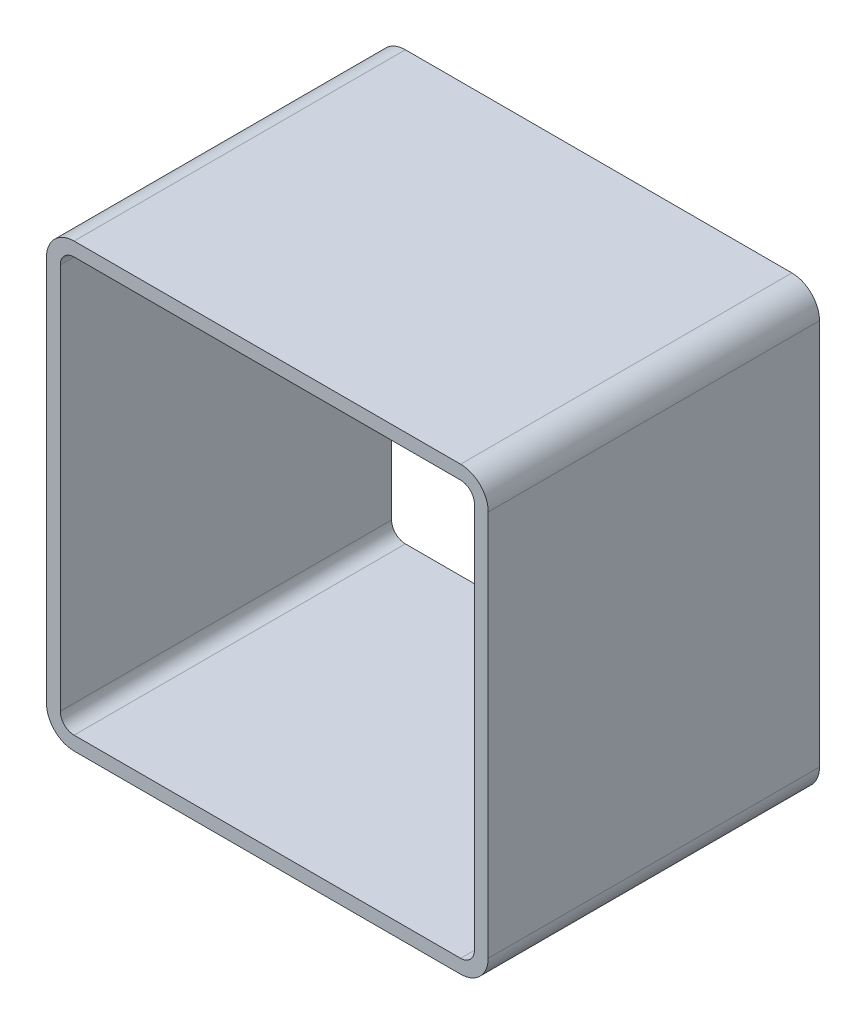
ISO-10303-21;
HEADER;
FILE_DESCRIPTION(('STEP AP214'),'2;1');
FILE_NAME('part.step','',(''),(''),'','','');
FILE_SCHEMA(('AUTOMOTIVE_DESIGN { 1 0 10303 214 1 1 1 1 }'));
ENDSEC;
DATA;
#1=APPLICATION_CONTEXT('core data for automotive mechanical design processes');
#2=APPLICATION_PROTOCOL_DEFINITION('international standard','automotive_design',2000,#1);
#3=PRODUCT_CONTEXT('',#1,'mechanical');
#4=PRODUCT('Part','Part','',(#3));
#5=PRODUCT_RELATED_PRODUCT_CATEGORY('part','',(#4));
#6=PRODUCT_DEFINITION_FORMATION('','',#4);
#7=PRODUCT_DEFINITION_CONTEXT('part definition',#1,'design');
#8=PRODUCT_DEFINITION('design','',#6,#7);
#9=PRODUCT_DEFINITION_SHAPE('','',#8);
#10=(LENGTH_UNIT() NAMED_UNIT(*) SI_UNIT(.MILLI.,.METRE.));
#11=(NAMED_UNIT(*) PLANE_ANGLE_UNIT() SI_UNIT($,.RADIAN.));
#12=(NAMED_UNIT(*) SI_UNIT($,.STERADIAN.) SOLID_ANGLE_UNIT());
#13=UNCERTAINTY_MEASURE_WITH_UNIT(LENGTH_MEASURE(1.E-05),#10,'distance_accuracy_value','');
#14=(GEOMETRIC_REPRESENTATION_CONTEXT(3) GLOBAL_UNCERTAINTY_ASSIGNED_CONTEXT((#13)) GLOBAL_UNIT_ASSIGNED_CONTEXT((#10,
#11,#12)) REPRESENTATION_CONTEXT('',''));
#15=CARTESIAN_POINT('',(0.,0.,0.));
#16=DIRECTION('',(0.,0.,1.));
#17=DIRECTION('',(1.,0.,0.));
#18=AXIS2_PLACEMENT_3D('',#15,#16,#17);
#19=CARTESIAN_POINT('',(381.822465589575,27.1828624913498,304.8));
#20=DIRECTION('',(0.,0.,1.));
#21=DIRECTION('',(1.,0.,0.));
#22=AXIS2_PLACEMENT_3D('',#19,#20,#21);
#23=PLANE('',#22);
#24=CARTESIAN_POINT('',(381.822465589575,27.1828624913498,304.8));
#25=DIRECTION('',(0.,0.,1.));
#26=DIRECTION('',(1.,0.,0.));
#27=AXIS2_PLACEMENT_3D('',#24,#25,#26);
#28=CIRCLE('',#27,25.4);
#29=CARTESIAN_POINT('',(381.822465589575,1.7828624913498,304.8));
#30=VERTEX_POINT('',#29);
#31=CARTESIAN_POINT('',(407.222465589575,27.1828624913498,304.8));
#32=VERTEX_POINT('',#31);
#33=EDGE_CURVE('E211',#30,#32,#28,.T.);
#34=ORIENTED_EDGE('',*,*,#33,.T.);
#35=DIRECTION('',(0.,1.,0.));
#36=VECTOR('',#35,1.);
#37=CARTESIAN_POINT('',(407.222465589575,382.78286249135,304.8));
#38=LINE('',#37,#36);
#39=CARTESIAN_POINT('',(407.222465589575,382.78286249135,304.8));
#40=VERTEX_POINT('',#39);
#41=EDGE_CURVE('E214',#32,#40,#38,.T.);
#42=ORIENTED_EDGE('',*,*,#41,.T.);
#43=CARTESIAN_POINT('',(381.822465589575,382.78286249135,304.8));
#44=DIRECTION('',(0.,0.,1.));
#45=DIRECTION('',(1.,0.,0.));
#46=AXIS2_PLACEMENT_3D('',#43,#44,#45);
#47=CIRCLE('',#46,25.4);
#48=CARTESIAN_POINT('',(381.822465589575,408.18286249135,304.8));
#49=VERTEX_POINT('',#48);
#50=EDGE_CURVE('E217',#40,#49,#47,.T.);
#51=ORIENTED_EDGE('',*,*,#50,.T.);
#52=DIRECTION('',(-1.,0.,0.));
#53=VECTOR('',#52,1.);
#54=CARTESIAN_POINT('',(26.222465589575,408.18286249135,304.8));
#55=LINE('',#54,#53);
#56=CARTESIAN_POINT('',(26.222465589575,408.18286249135,304.8));
#57=VERTEX_POINT('',#56);
#58=EDGE_CURVE('E219',#49,#57,#55,.T.);
#59=ORIENTED_EDGE('',*,*,#58,.T.);
#60=CARTESIAN_POINT('',(26.222465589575,382.78286249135,304.8));
#61=DIRECTION('',(0.,0.,1.));
#62=DIRECTION('',(1.,0.,0.));
#63=AXIS2_PLACEMENT_3D('',#60,#61,#62);
#64=CIRCLE('',#63,25.4);
#65=CARTESIAN_POINT('',(0.82246558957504,382.78286249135,304.8));
#66=VERTEX_POINT('',#65);
#67=EDGE_CURVE('E221',#57,#66,#64,.T.);
#68=ORIENTED_EDGE('',*,*,#67,.T.);
#69=DIRECTION('',(0.,-1.,0.));
#70=VECTOR('',#69,1.);
#71=CARTESIAN_POINT('',(0.82246558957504,27.1828624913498,304.8));
#72=LINE('',#71,#70);
#73=CARTESIAN_POINT('',(0.822465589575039,27.1828624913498,304.8));
#74=VERTEX_POINT('',#73);
#75=EDGE_CURVE('E223',#66,#74,#72,.T.);
#76=ORIENTED_EDGE('',*,*,#75,.T.);
#77=CARTESIAN_POINT('',(26.222465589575,27.1828624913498,304.8));
#78=DIRECTION('',(0.,0.,1.));
#79=DIRECTION('',(1.,0.,0.));
#80=AXIS2_PLACEMENT_3D('',#77,#78,#79);
#81=CIRCLE('',#80,25.4);
#82=CARTESIAN_POINT('',(26.222465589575,1.7828624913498,304.8));
#83=VERTEX_POINT('',#82);
#84=EDGE_CURVE('E225',#74,#83,#81,.T.);
#85=ORIENTED_EDGE('',*,*,#84,.T.);
#86=DIRECTION('',(1.,0.,0.));
#87=VECTOR('',#86,1.);
#88=CARTESIAN_POINT('',(381.822465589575,1.7828624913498,304.8));
#89=LINE('',#88,#87);
#90=EDGE_CURVE('E227',#83,#30,#89,.T.);
#91=ORIENTED_EDGE('',*,*,#90,.T.);
#92=EDGE_LOOP('',(#34,#42,#51,#59,#68,#76,#85,#91));
#93=FACE_BOUND('',#92,.T.);
#94=DIRECTION('',(0.,-1.,0.));
#95=VECTOR('',#94,1.);
#96=CARTESIAN_POINT('',(13.522465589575,27.1828624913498,304.8));
#97=LINE('',#96,#95);
#98=CARTESIAN_POINT('',(13.522465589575,382.78286249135,304.8));
#99=VERTEX_POINT('',#98);
#100=CARTESIAN_POINT('',(13.522465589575,27.1828624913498,304.8));
#101=VERTEX_POINT('',#100);
#102=EDGE_CURVE('E154',#99,#101,#97,.T.);
#103=ORIENTED_EDGE('',*,*,#102,.F.);
#104=CARTESIAN_POINT('',(26.222465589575,382.78286249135,304.8));
#105=DIRECTION('',(0.,0.,1.));
#106=DIRECTION('',(1.,0.,0.));
#107=AXIS2_PLACEMENT_3D('',#104,#105,#106);
#108=CIRCLE('',#107,12.7);
#109=CARTESIAN_POINT('',(26.222465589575,395.48286249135,304.8));
#110=VERTEX_POINT('',#109);
#111=EDGE_CURVE('E146',#110,#99,#108,.T.);
#112=ORIENTED_EDGE('',*,*,#111,.F.);
#113=DIRECTION('',(-1.,0.,0.));
#114=VECTOR('',#113,1.);
#115=CARTESIAN_POINT('',(26.222465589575,395.48286249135,304.8));
#116=LINE('',#115,#114);
#117=CARTESIAN_POINT('',(381.822465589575,395.48286249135,304.8));
#118=VERTEX_POINT('',#117);
#119=EDGE_CURVE('E179',#118,#110,#116,.T.);
#120=ORIENTED_EDGE('',*,*,#119,.F.);
#121=CARTESIAN_POINT('',(381.822465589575,382.78286249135,304.8));
#122=DIRECTION('',(0.,0.,1.));
#123=DIRECTION('',(1.,0.,0.));
#124=AXIS2_PLACEMENT_3D('',#121,#122,#123);
#125=CIRCLE('',#124,12.7);
#126=CARTESIAN_POINT('',(394.522465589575,382.78286249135,304.8));
#127=VERTEX_POINT('',#126);
#128=EDGE_CURVE('E177',#127,#118,#125,.T.);
#129=ORIENTED_EDGE('',*,*,#128,.F.);
#130=DIRECTION('',(0.,1.,0.));
#131=VECTOR('',#130,1.);
#132=CARTESIAN_POINT('',(394.522465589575,382.78286249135,304.8));
#133=LINE('',#132,#131);
#134=CARTESIAN_POINT('',(394.522465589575,27.1828624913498,304.8));
#135=VERTEX_POINT('',#134);
#136=EDGE_CURVE('E175',#135,#127,#133,.T.);
#137=ORIENTED_EDGE('',*,*,#136,.F.);
#138=CARTESIAN_POINT('',(381.822465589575,27.1828624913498,304.8));
#139=DIRECTION('',(0.,0.,1.));
#140=DIRECTION('',(1.,0.,0.));
#141=AXIS2_PLACEMENT_3D('',#138,#139,#140);
#142=CIRCLE('',#141,12.7);
#143=CARTESIAN_POINT('',(381.822465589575,14.4828624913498,304.8));
#144=VERTEX_POINT('',#143);
#145=EDGE_CURVE('E173',#144,#135,#142,.T.);
#146=ORIENTED_EDGE('',*,*,#145,.F.);
#147=DIRECTION('',(1.,0.,0.));
#148=VECTOR('',#147,1.);
#149=CARTESIAN_POINT('',(381.822465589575,14.4828624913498,304.8));
#150=LINE('',#149,#148);
#151=CARTESIAN_POINT('',(26.222465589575,14.4828624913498,304.8));
#152=VERTEX_POINT('',#151);
#153=EDGE_CURVE('E169',#152,#144,#150,.T.);
#154=ORIENTED_EDGE('',*,*,#153,.F.);
#155=CARTESIAN_POINT('',(26.222465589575,27.1828624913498,304.8));
#156=DIRECTION('',(0.,0.,1.));
#157=DIRECTION('',(1.,0.,0.));
#158=AXIS2_PLACEMENT_3D('',#155,#156,#157);
#159=CIRCLE('',#158,12.7);
#160=EDGE_CURVE('E167',#101,#152,#159,.T.);
#161=ORIENTED_EDGE('',*,*,#160,.F.);
#162=EDGE_LOOP('',(#103,#112,#120,#129,#137,#146,#154,#161));
#163=FACE_BOUND('',#162,.T.);
#164=ADVANCED_FACE('F33',(#93,#163),#23,.T.);
#165=CARTESIAN_POINT('',(381.822465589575,27.1828624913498,0.));
#166=DIRECTION('',(0.,0.,1.));
#167=DIRECTION('',(1.,0.,0.));
#168=AXIS2_PLACEMENT_3D('',#165,#166,#167);
#169=PLANE('',#168);
#170=CARTESIAN_POINT('',(381.822465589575,27.1828624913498,0.));
#171=DIRECTION('',(0.,0.,1.));
#172=DIRECTION('',(1.,0.,0.));
#173=AXIS2_PLACEMENT_3D('',#170,#171,#172);
#174=CIRCLE('',#173,25.4);
#175=CARTESIAN_POINT('',(381.822465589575,1.7828624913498,0.));
#176=VERTEX_POINT('',#175);
#177=CARTESIAN_POINT('',(407.222465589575,27.1828624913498,0.));
#178=VERTEX_POINT('',#177);
#179=EDGE_CURVE('E162',#176,#178,#174,.T.);
#180=ORIENTED_EDGE('',*,*,#179,.F.);
#181=DIRECTION('',(1.,0.,0.));
#182=VECTOR('',#181,1.);
#183=CARTESIAN_POINT('',(381.822465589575,1.7828624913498,0.));
#184=LINE('',#183,#182);
#185=CARTESIAN_POINT('',(26.222465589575,1.7828624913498,0.));
#186=VERTEX_POINT('',#185);
#187=EDGE_CURVE('E215',#186,#176,#184,.T.);
#188=ORIENTED_EDGE('',*,*,#187,.F.);
#189=CARTESIAN_POINT('',(26.222465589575,27.1828624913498,0.));
#190=DIRECTION('',(0.,0.,1.));
#191=DIRECTION('',(1.,0.,0.));
#192=AXIS2_PLACEMENT_3D('',#189,#190,#191);
#193=CIRCLE('',#192,25.4);
#194=CARTESIAN_POINT('',(0.822465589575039,27.1828624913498,0.));
#195=VERTEX_POINT('',#194);
#196=EDGE_CURVE('E242',#195,#186,#193,.T.);
#197=ORIENTED_EDGE('',*,*,#196,.F.);
#198=DIRECTION('',(0.,-1.,0.));
#199=VECTOR('',#198,1.);
#200=CARTESIAN_POINT('',(0.82246558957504,27.1828624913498,0.));
#201=LINE('',#200,#199);
#202=CARTESIAN_POINT('',(0.82246558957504,382.78286249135,0.));
#203=VERTEX_POINT('',#202);
#204=EDGE_CURVE('E240',#203,#195,#201,.T.);
#205=ORIENTED_EDGE('',*,*,#204,.F.);
#206=CARTESIAN_POINT('',(26.222465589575,382.78286249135,0.));
#207=DIRECTION('',(0.,0.,1.));
#208=DIRECTION('',(1.,0.,0.));
#209=AXIS2_PLACEMENT_3D('',#206,#207,#208);
#210=CIRCLE('',#209,25.4);
#211=CARTESIAN_POINT('',(26.222465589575,408.18286249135,0.));
#212=VERTEX_POINT('',#211);
#213=EDGE_CURVE('E238',#212,#203,#210,.T.);
#214=ORIENTED_EDGE('',*,*,#213,.F.);
#215=DIRECTION('',(-1.,0.,0.));
#216=VECTOR('',#215,1.);
#217=CARTESIAN_POINT('',(26.222465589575,408.18286249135,0.));
#218=LINE('',#217,#216);
#219=CARTESIAN_POINT('',(381.822465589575,408.18286249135,0.));
#220=VERTEX_POINT('',#219);
#221=EDGE_CURVE('E236',#220,#212,#218,.T.);
#222=ORIENTED_EDGE('',*,*,#221,.F.);
#223=CARTESIAN_POINT('',(381.822465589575,382.78286249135,0.));
#224=DIRECTION('',(0.,0.,1.));
#225=DIRECTION('',(1.,0.,0.));
#226=AXIS2_PLACEMENT_3D('',#223,#224,#225);
#227=CIRCLE('',#226,25.4);
#228=CARTESIAN_POINT('',(407.222465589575,382.78286249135,0.));
#229=VERTEX_POINT('',#228);
#230=EDGE_CURVE('E234',#229,#220,#227,.T.);
#231=ORIENTED_EDGE('',*,*,#230,.F.);
#232=DIRECTION('',(0.,1.,0.));
#233=VECTOR('',#232,1.);
#234=CARTESIAN_POINT('',(407.222465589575,382.78286249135,0.));
#235=LINE('',#234,#233);
#236=EDGE_CURVE('E232',#178,#229,#235,.T.);
#237=ORIENTED_EDGE('',*,*,#236,.F.);
#238=EDGE_LOOP('',(#180,#188,#197,#205,#214,#222,#231,#237));
#239=FACE_BOUND('',#238,.T.);
#240=CARTESIAN_POINT('',(26.222465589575,382.78286249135,0.));
#241=DIRECTION('',(0.,0.,1.));
#242=DIRECTION('',(1.,0.,0.));
#243=AXIS2_PLACEMENT_3D('',#240,#241,#242);
#244=CIRCLE('',#243,12.7);
#245=CARTESIAN_POINT('',(26.222465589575,395.48286249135,0.));
#246=VERTEX_POINT('',#245);
#247=CARTESIAN_POINT('',(13.522465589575,382.78286249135,0.));
#248=VERTEX_POINT('',#247);
#249=EDGE_CURVE('E56',#246,#248,#244,.T.);
#250=ORIENTED_EDGE('',*,*,#249,.T.);
#251=DIRECTION('',(0.,-1.,0.));
#252=VECTOR('',#251,1.);
#253=CARTESIAN_POINT('',(13.522465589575,27.1828624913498,0.));
#254=LINE('',#253,#252);
#255=CARTESIAN_POINT('',(13.522465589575,27.1828624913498,0.));
#256=VERTEX_POINT('',#255);
#257=EDGE_CURVE('E161',#248,#256,#254,.T.);
#258=ORIENTED_EDGE('',*,*,#257,.T.);
#259=CARTESIAN_POINT('',(26.222465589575,27.1828624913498,0.));
#260=DIRECTION('',(0.,0.,1.));
#261=DIRECTION('',(1.,0.,0.));
#262=AXIS2_PLACEMENT_3D('',#259,#260,#261);
#263=CIRCLE('',#262,12.7);
#264=CARTESIAN_POINT('',(26.222465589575,14.4828624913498,0.));
#265=VERTEX_POINT('',#264);
#266=EDGE_CURVE('E183',#256,#265,#263,.T.);
#267=ORIENTED_EDGE('',*,*,#266,.T.);
#268=DIRECTION('',(1.,0.,0.));
#269=VECTOR('',#268,1.);
#270=CARTESIAN_POINT('',(381.822465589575,14.4828624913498,0.));
#271=LINE('',#270,#269);
#272=CARTESIAN_POINT('',(381.822465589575,14.4828624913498,0.));
#273=VERTEX_POINT('',#272);
#274=EDGE_CURVE('E186',#265,#273,#271,.T.);
#275=ORIENTED_EDGE('',*,*,#274,.T.);
#276=CARTESIAN_POINT('',(381.822465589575,27.1828624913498,0.));
#277=DIRECTION('',(0.,0.,1.));
#278=DIRECTION('',(1.,0.,0.));
#279=AXIS2_PLACEMENT_3D('',#276,#277,#278);
#280=CIRCLE('',#279,12.7);
#281=CARTESIAN_POINT('',(394.522465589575,27.1828624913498,0.));
#282=VERTEX_POINT('',#281);
#283=EDGE_CURVE('E189',#273,#282,#280,.T.);
#284=ORIENTED_EDGE('',*,*,#283,.T.);
#285=DIRECTION('',(0.,1.,0.));
#286=VECTOR('',#285,1.);
#287=CARTESIAN_POINT('',(394.522465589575,382.78286249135,0.));
#288=LINE('',#287,#286);
#289=CARTESIAN_POINT('',(394.522465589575,382.78286249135,0.));
#290=VERTEX_POINT('',#289);
#291=EDGE_CURVE('E192',#282,#290,#288,.T.);
#292=ORIENTED_EDGE('',*,*,#291,.T.);
#293=CARTESIAN_POINT('',(381.822465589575,382.78286249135,0.));
#294=DIRECTION('',(0.,0.,1.));
#295=DIRECTION('',(1.,0.,0.));
#296=AXIS2_PLACEMENT_3D('',#293,#294,#295);
#297=CIRCLE('',#296,12.7);
#298=CARTESIAN_POINT('',(381.822465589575,395.48286249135,0.));
#299=VERTEX_POINT('',#298);
#300=EDGE_CURVE('E195',#290,#299,#297,.T.);
#301=ORIENTED_EDGE('',*,*,#300,.T.);
#302=DIRECTION('',(-1.,0.,0.));
#303=VECTOR('',#302,1.);
#304=CARTESIAN_POINT('',(26.222465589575,395.48286249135,0.));
#305=LINE('',#304,#303);
#306=EDGE_CURVE('E155',#299,#246,#305,.T.);
#307=ORIENTED_EDGE('',*,*,#306,.T.);
#308=EDGE_LOOP('',(#250,#258,#267,#275,#284,#292,#301,#307));
#309=FACE_BOUND('',#308,.T.);
#310=ADVANCED_FACE('F272',(#239,#309),#169,.F.);
#311=CARTESIAN_POINT('',(381.822465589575,27.1828624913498,304.8));
#312=DIRECTION('',(0.,0.,-1.));
#313=DIRECTION('',(-1.,0.,0.));
#314=AXIS2_PLACEMENT_3D('',#311,#312,#313);
#315=CYLINDRICAL_SURFACE('',#314,25.4);
#316=ORIENTED_EDGE('',*,*,#179,.T.);
#317=DIRECTION('',(0.,0.,-1.));
#318=VECTOR('',#317,1.);
#319=CARTESIAN_POINT('',(407.222465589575,27.1828624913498,304.8));
#320=LINE('',#319,#318);
#321=EDGE_CURVE('E11',#32,#178,#320,.T.);
#322=ORIENTED_EDGE('',*,*,#321,.F.);
#323=ORIENTED_EDGE('',*,*,#33,.F.);
#324=DIRECTION('',(0.,0.,-1.));
#325=VECTOR('',#324,1.);
#326=CARTESIAN_POINT('',(381.822465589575,1.7828624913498,304.8));
#327=LINE('',#326,#325);
#328=EDGE_CURVE('E229',#30,#176,#327,.T.);
#329=ORIENTED_EDGE('',*,*,#328,.T.);
#330=EDGE_LOOP('',(#316,#322,#323,#329));
#331=FACE_BOUND('',#330,.T.);
#332=ADVANCED_FACE('F35',(#331),#315,.T.);
#333=CARTESIAN_POINT('',(407.222465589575,382.78286249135,304.8));
#334=DIRECTION('',(-1.,0.,0.));
#335=DIRECTION('',(0.,0.,1.));
#336=AXIS2_PLACEMENT_3D('',#333,#334,#335);
#337=PLANE('',#336);
#338=ORIENTED_EDGE('',*,*,#236,.T.);
#339=DIRECTION('',(0.,0.,-1.));
#340=VECTOR('',#339,1.);
#341=CARTESIAN_POINT('',(407.222465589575,382.78286249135,304.8));
#342=LINE('',#341,#340);
#343=EDGE_CURVE('E41',#40,#229,#342,.T.);
#344=ORIENTED_EDGE('',*,*,#343,.F.);
#345=ORIENTED_EDGE('',*,*,#41,.F.);
#346=ORIENTED_EDGE('',*,*,#321,.T.);
#347=EDGE_LOOP('',(#338,#344,#345,#346));
#348=FACE_BOUND('',#347,.T.);
#349=ADVANCED_FACE('F289',(#348),#337,.F.);
#350=CARTESIAN_POINT('',(381.822465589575,382.78286249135,304.8));
#351=DIRECTION('',(0.,0.,-1.));
#352=DIRECTION('',(-1.,0.,0.));
#353=AXIS2_PLACEMENT_3D('',#350,#351,#352);
#354=CYLINDRICAL_SURFACE('',#353,25.4);
#355=ORIENTED_EDGE('',*,*,#230,.T.);
#356=DIRECTION('',(0.,0.,-1.));
#357=VECTOR('',#356,1.);
#358=CARTESIAN_POINT('',(381.822465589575,408.18286249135,304.8));
#359=LINE('',#358,#357);
#360=EDGE_CURVE('E259',#49,#220,#359,.T.);
#361=ORIENTED_EDGE('',*,*,#360,.F.);
#362=ORIENTED_EDGE('',*,*,#50,.F.);
#363=ORIENTED_EDGE('',*,*,#343,.T.);
#364=EDGE_LOOP('',(#355,#361,#362,#363));
#365=FACE_BOUND('',#364,.T.);
#366=ADVANCED_FACE('F266',(#365),#354,.T.);
#367=CARTESIAN_POINT('',(26.222465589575,408.18286249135,304.8));
#368=DIRECTION('',(0.,-1.,0.));
#369=DIRECTION('',(0.,0.,-1.));
#370=AXIS2_PLACEMENT_3D('',#367,#368,#369);
#371=PLANE('',#370);
#372=ORIENTED_EDGE('',*,*,#221,.T.);
#373=DIRECTION('',(0.,0.,-1.));
#374=VECTOR('',#373,1.);
#375=CARTESIAN_POINT('',(26.222465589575,408.18286249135,304.8));
#376=LINE('',#375,#374);
#377=EDGE_CURVE('E256',#57,#212,#376,.T.);
#378=ORIENTED_EDGE('',*,*,#377,.F.);
#379=ORIENTED_EDGE('',*,*,#58,.F.);
#380=ORIENTED_EDGE('',*,*,#360,.T.);
#381=EDGE_LOOP('',(#372,#378,#379,#380));
#382=FACE_BOUND('',#381,.T.);
#383=ADVANCED_FACE('F278',(#382),#371,.F.);
#384=CARTESIAN_POINT('',(26.222465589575,382.78286249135,304.8));
#385=DIRECTION('',(0.,0.,-1.));
#386=DIRECTION('',(-1.,0.,0.));
#387=AXIS2_PLACEMENT_3D('',#384,#385,#386);
#388=CYLINDRICAL_SURFACE('',#387,25.4);
#389=ORIENTED_EDGE('',*,*,#213,.T.);
#390=DIRECTION('',(0.,0.,-1.));
#391=VECTOR('',#390,1.);
#392=CARTESIAN_POINT('',(0.82246558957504,382.78286249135,304.8));
#393=LINE('',#392,#391);
#394=EDGE_CURVE('E253',#66,#203,#393,.T.);
#395=ORIENTED_EDGE('',*,*,#394,.F.);
#396=ORIENTED_EDGE('',*,*,#67,.F.);
#397=ORIENTED_EDGE('',*,*,#377,.T.);
#398=EDGE_LOOP('',(#389,#395,#396,#397));
#399=FACE_BOUND('',#398,.T.);
#400=ADVANCED_FACE('F282',(#399),#388,.T.);
#401=CARTESIAN_POINT('',(0.82246558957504,27.1828624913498,304.8));
#402=DIRECTION('',(1.,0.,0.));
#403=DIRECTION('',(0.,0.,-1.));
#404=AXIS2_PLACEMENT_3D('',#401,#402,#403);
#405=PLANE('',#404);
#406=ORIENTED_EDGE('',*,*,#204,.T.);
#407=DIRECTION('',(0.,0.,-1.));
#408=VECTOR('',#407,1.);
#409=CARTESIAN_POINT('',(0.822465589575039,27.1828624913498,304.8));
#410=LINE('',#409,#408);
#411=EDGE_CURVE('E250',#74,#195,#410,.T.);
#412=ORIENTED_EDGE('',*,*,#411,.F.);
#413=ORIENTED_EDGE('',*,*,#75,.F.);
#414=ORIENTED_EDGE('',*,*,#394,.T.);
#415=EDGE_LOOP('',(#406,#412,#413,#414));
#416=FACE_BOUND('',#415,.T.);
#417=ADVANCED_FACE('F302',(#416),#405,.F.);
#418=CARTESIAN_POINT('',(26.222465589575,27.1828624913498,304.8));
#419=DIRECTION('',(0.,0.,-1.));
#420=DIRECTION('',(-1.,0.,0.));
#421=AXIS2_PLACEMENT_3D('',#418,#419,#420);
#422=CYLINDRICAL_SURFACE('',#421,25.4);
#423=ORIENTED_EDGE('',*,*,#196,.T.);
#424=DIRECTION('',(0.,0.,-1.));
#425=VECTOR('',#424,1.);
#426=CARTESIAN_POINT('',(26.222465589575,1.7828624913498,304.8));
#427=LINE('',#426,#425);
#428=EDGE_CURVE('E247',#83,#186,#427,.T.);
#429=ORIENTED_EDGE('',*,*,#428,.F.);
#430=ORIENTED_EDGE('',*,*,#84,.F.);
#431=ORIENTED_EDGE('',*,*,#411,.T.);
#432=EDGE_LOOP('',(#423,#429,#430,#431));
#433=FACE_BOUND('',#432,.T.);
#434=ADVANCED_FACE('F300',(#433),#422,.T.);
#435=CARTESIAN_POINT('',(381.822465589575,1.7828624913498,304.8));
#436=DIRECTION('',(0.,1.,0.));
#437=DIRECTION('',(0.,0.,1.));
#438=AXIS2_PLACEMENT_3D('',#435,#436,#437);
#439=PLANE('',#438);
#440=ORIENTED_EDGE('',*,*,#187,.T.);
#441=ORIENTED_EDGE('',*,*,#328,.F.);
#442=ORIENTED_EDGE('',*,*,#90,.F.);
#443=ORIENTED_EDGE('',*,*,#428,.T.);
#444=EDGE_LOOP('',(#440,#441,#442,#443));
#445=FACE_BOUND('',#444,.T.);
#446=ADVANCED_FACE('F295',(#445),#439,.F.);
#447=CARTESIAN_POINT('',(26.222465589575,382.78286249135,304.8));
#448=DIRECTION('',(0.,0.,-1.));
#449=DIRECTION('',(-1.,0.,0.));
#450=AXIS2_PLACEMENT_3D('',#447,#448,#449);
#451=CYLINDRICAL_SURFACE('',#450,12.7);
#452=ORIENTED_EDGE('',*,*,#249,.F.);
#453=DIRECTION('',(0.,0.,-1.));
#454=VECTOR('',#453,1.);
#455=CARTESIAN_POINT('',(26.222465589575,395.48286249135,304.8));
#456=LINE('',#455,#454);
#457=EDGE_CURVE('E150',#110,#246,#456,.T.);
#458=ORIENTED_EDGE('',*,*,#457,.F.);
#459=ORIENTED_EDGE('',*,*,#111,.T.);
#460=DIRECTION('',(0.,0.,-1.));
#461=VECTOR('',#460,1.);
#462=CARTESIAN_POINT('',(13.522465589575,382.78286249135,304.8));
#463=LINE('',#462,#461);
#464=EDGE_CURVE('E149',#99,#248,#463,.T.);
#465=ORIENTED_EDGE('',*,*,#464,.T.);
#466=EDGE_LOOP('',(#452,#458,#459,#465));
#467=FACE_BOUND('',#466,.T.);
#468=ADVANCED_FACE('F148',(#467),#451,.F.);
#469=CARTESIAN_POINT('',(13.522465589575,27.1828624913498,304.8));
#470=DIRECTION('',(1.,0.,0.));
#471=DIRECTION('',(0.,0.,-1.));
#472=AXIS2_PLACEMENT_3D('',#469,#470,#471);
#473=PLANE('',#472);
#474=ORIENTED_EDGE('',*,*,#257,.F.);
#475=ORIENTED_EDGE('',*,*,#464,.F.);
#476=ORIENTED_EDGE('',*,*,#102,.T.);
#477=DIRECTION('',(0.,0.,-1.));
#478=VECTOR('',#477,1.);
#479=CARTESIAN_POINT('',(13.522465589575,27.1828624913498,304.8));
#480=LINE('',#479,#478);
#481=EDGE_CURVE('E163',#101,#256,#480,.T.);
#482=ORIENTED_EDGE('',*,*,#481,.T.);
#483=EDGE_LOOP('',(#474,#475,#476,#482));
#484=FACE_BOUND('',#483,.T.);
#485=ADVANCED_FACE('F158',(#484),#473,.T.);
#486=CARTESIAN_POINT('',(26.222465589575,27.1828624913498,304.8));
#487=DIRECTION('',(0.,0.,-1.));
#488=DIRECTION('',(-1.,0.,0.));
#489=AXIS2_PLACEMENT_3D('',#486,#487,#488);
#490=CYLINDRICAL_SURFACE('',#489,12.7);
#491=ORIENTED_EDGE('',*,*,#266,.F.);
#492=ORIENTED_EDGE('',*,*,#481,.F.);
#493=ORIENTED_EDGE('',*,*,#160,.T.);
#494=DIRECTION('',(0.,0.,-1.));
#495=VECTOR('',#494,1.);
#496=CARTESIAN_POINT('',(26.222465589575,14.4828624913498,304.8));
#497=LINE('',#496,#495);
#498=EDGE_CURVE('E208',#152,#265,#497,.T.);
#499=ORIENTED_EDGE('',*,*,#498,.T.);
#500=EDGE_LOOP('',(#491,#492,#493,#499));
#501=FACE_BOUND('',#500,.T.);
#502=ADVANCED_FACE('F327',(#501),#490,.F.);
#503=CARTESIAN_POINT('',(381.822465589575,14.4828624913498,304.8));
#504=DIRECTION('',(0.,1.,0.));
#505=DIRECTION('',(0.,0.,1.));
#506=AXIS2_PLACEMENT_3D('',#503,#504,#505);
#507=PLANE('',#506);
#508=ORIENTED_EDGE('',*,*,#274,.F.);
#509=ORIENTED_EDGE('',*,*,#498,.F.);
#510=ORIENTED_EDGE('',*,*,#153,.T.);
#511=DIRECTION('',(0.,0.,-1.));
#512=VECTOR('',#511,1.);
#513=CARTESIAN_POINT('',(381.822465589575,14.4828624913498,304.8));
#514=LINE('',#513,#512);
#515=EDGE_CURVE('E206',#144,#273,#514,.T.);
#516=ORIENTED_EDGE('',*,*,#515,.T.);
#517=EDGE_LOOP('',(#508,#509,#510,#516));
#518=FACE_BOUND('',#517,.T.);
#519=ADVANCED_FACE('F331',(#518),#507,.T.);
#520=CARTESIAN_POINT('',(381.822465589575,27.1828624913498,304.8));
#521=DIRECTION('',(0.,0.,-1.));
#522=DIRECTION('',(-1.,0.,0.));
#523=AXIS2_PLACEMENT_3D('',#520,#521,#522);
#524=CYLINDRICAL_SURFACE('',#523,12.7);
#525=ORIENTED_EDGE('',*,*,#283,.F.);
#526=ORIENTED_EDGE('',*,*,#515,.F.);
#527=ORIENTED_EDGE('',*,*,#145,.T.);
#528=DIRECTION('',(0.,0.,-1.));
#529=VECTOR('',#528,1.);
#530=CARTESIAN_POINT('',(394.522465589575,27.1828624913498,304.8));
#531=LINE('',#530,#529);
#532=EDGE_CURVE('E204',#135,#282,#531,.T.);
#533=ORIENTED_EDGE('',*,*,#532,.T.);
#534=EDGE_LOOP('',(#525,#526,#527,#533));
#535=FACE_BOUND('',#534,.T.);
#536=ADVANCED_FACE('F337',(#535),#524,.F.);
#537=CARTESIAN_POINT('',(394.522465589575,382.78286249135,304.8));
#538=DIRECTION('',(-1.,0.,0.));
#539=DIRECTION('',(0.,0.,1.));
#540=AXIS2_PLACEMENT_3D('',#537,#538,#539);
#541=PLANE('',#540);
#542=ORIENTED_EDGE('',*,*,#291,.F.);
#543=ORIENTED_EDGE('',*,*,#532,.F.);
#544=ORIENTED_EDGE('',*,*,#136,.T.);
#545=DIRECTION('',(0.,0.,-1.));
#546=VECTOR('',#545,1.);
#547=CARTESIAN_POINT('',(394.522465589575,382.78286249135,304.8));
#548=LINE('',#547,#546);
#549=EDGE_CURVE('E202',#127,#290,#548,.T.);
#550=ORIENTED_EDGE('',*,*,#549,.T.);
#551=EDGE_LOOP('',(#542,#543,#544,#550));
#552=FACE_BOUND('',#551,.T.);
#553=ADVANCED_FACE('F341',(#552),#541,.T.);
#554=CARTESIAN_POINT('',(381.822465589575,382.78286249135,304.8));
#555=DIRECTION('',(0.,0.,-1.));
#556=DIRECTION('',(-1.,0.,0.));
#557=AXIS2_PLACEMENT_3D('',#554,#555,#556);
#558=CYLINDRICAL_SURFACE('',#557,12.7);
#559=ORIENTED_EDGE('',*,*,#300,.F.);
#560=ORIENTED_EDGE('',*,*,#549,.F.);
#561=ORIENTED_EDGE('',*,*,#128,.T.);
#562=DIRECTION('',(0.,0.,-1.));
#563=VECTOR('',#562,1.);
#564=CARTESIAN_POINT('',(381.822465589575,395.48286249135,304.8));
#565=LINE('',#564,#563);
#566=EDGE_CURVE('E48',#118,#299,#565,.T.);
#567=ORIENTED_EDGE('',*,*,#566,.T.);
#568=EDGE_LOOP('',(#559,#560,#561,#567));
#569=FACE_BOUND('',#568,.T.);
#570=ADVANCED_FACE('F345',(#569),#558,.F.);
#571=CARTESIAN_POINT('',(26.222465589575,395.48286249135,304.8));
#572=DIRECTION('',(0.,-1.,0.));
#573=DIRECTION('',(0.,0.,-1.));
#574=AXIS2_PLACEMENT_3D('',#571,#572,#573);
#575=PLANE('',#574);
#576=ORIENTED_EDGE('',*,*,#306,.F.);
#577=ORIENTED_EDGE('',*,*,#566,.F.);
#578=ORIENTED_EDGE('',*,*,#119,.T.);
#579=ORIENTED_EDGE('',*,*,#457,.T.);
#580=EDGE_LOOP('',(#576,#577,#578,#579));
#581=FACE_BOUND('',#580,.T.);
#582=ADVANCED_FACE('F349',(#581),#575,.T.);
#583=CLOSED_SHELL('',(#164,#310,#332,#349,#366,#383,#400,#417,#434,#446,#468,#485,#502,#519,
#536,#553,#570,#582));
#584=MANIFOLD_SOLID_BREP('B2',#583);
#585=ADVANCED_BREP_SHAPE_REPRESENTATION('',(#18,#584),#14);
#586=SHAPE_DEFINITION_REPRESENTATION(#9,#585);
ENDSEC;
END-ISO-10303-21;
